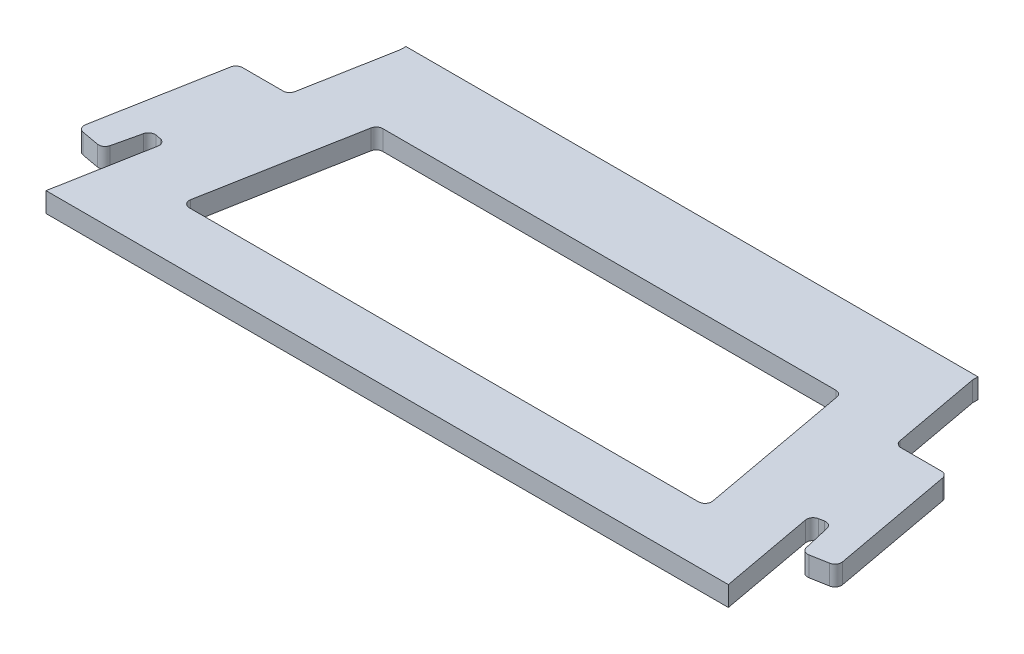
from build123d import *

# Parameters (mm, degrees)
BOSS_EXTRUDE1_DEPTH = 12


with BuildPart() as part:
    # Sketch1 → Boss-Extrude1 (new body)
    with BuildSketch(Plane(origin=(0, 0, 0), x_dir=(1, 0, 0), z_dir=(0, 1, 0))):
        with BuildLine():
            Line((0, 0), (10.523720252, 57.124709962))
            ThreePointArc((10.523720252, 57.124709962), (9.888523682, 60.111972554), (7.330401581, 61.780272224))
            Line((7.330401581, 61.780272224), (4.252092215, 62.360155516))
            ThreePointArc((4.252092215, 62.360155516), (1.324463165, 61.778382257), (-0.385272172, 59.331695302))
            Line((-0.385272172, 59.331695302), (-4.177618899, 42.955059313))
            ThreePointArc((-4.177618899, 42.955059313), (-5.875677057, 40.51602732), (-8.787522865, 39.921525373))
            Line((-8.787522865, 39.921525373), (-19.383346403, 41.841038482))
            ThreePointArc((-19.383346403, 41.841038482), (-21.96101101, 43.502911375), (-22.604125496, 46.50167447))
            Line((-22.604125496, 46.50167447), (-8.952598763, 120.604699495))
            ThreePointArc((-8.952598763, 120.604699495), (-7.578209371, 122.953987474), (-5.018795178, 123.88))
            Line((-5.018795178, 123.88), (19.491204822, 123.88))
            ThreePointArc((19.491204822, 123.88), (22.050619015, 124.806012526), (23.425008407, 127.155300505))
            Line((23.425008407, 127.155300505), (33.35, 181.03))
            Line((33.35, 181.03), (33.35, 184.33))
            Line((33.35, 184.33), (379.35, 184.33))
            Line((379.35, 184.33), (379.35, 181.03))
            Line((379.35, 181.03), (389.274991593, 127.155300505))
            ThreePointArc((389.274991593, 127.155300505), (390.649380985, 124.806012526), (393.208795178, 123.88))
            Line((393.208795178, 123.88), (417.718795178, 123.88))
            ThreePointArc((417.718795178, 123.88), (420.278209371, 122.953987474), (421.652598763, 120.604699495))
            Line((421.652598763, 120.604699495), (435.304125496, 46.50167447))
            ThreePointArc((435.304125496, 46.50167447), (434.66101101, 43.502911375), (432.083346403, 41.841038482))
            Line((432.083346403, 41.841038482), (421.487522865, 39.921525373))
            ThreePointArc((421.487522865, 39.921525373), (418.575677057, 40.51602732), (416.877618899, 42.955059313))
            Line((416.877618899, 42.955059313), (413.085272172, 59.331695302))
            ThreePointArc((413.085272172, 59.331695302), (411.375536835, 61.778382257), (408.447907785, 62.360155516))
            Line((408.447907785, 62.360155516), (405.369598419, 61.780272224))
            ThreePointArc((405.369598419, 61.780272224), (402.811476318, 60.111972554), (402.176279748, 57.124709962))
            Line((402.176279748, 57.124709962), (412.7, 0))
            Line((412.7, 0), (0, 0))
        make_face()
        with BuildLine():
            Line((343.339626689, 134.33), (69.360373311, 134.33))
            ThreePointArc((69.360373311, 134.33), (66.800959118, 133.403987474), (65.426569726, 131.054699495))
            Line((65.426569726, 131.054699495), (48.477997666, 39.054699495))
            ThreePointArc((48.477997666, 39.054699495), (49.337813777, 35.770585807), (52.411801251, 34.33))
            Line((52.411801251, 34.33), (360.288198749, 34.33))
            ThreePointArc((360.288198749, 34.33), (363.362186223, 35.770585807), (364.222002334, 39.054699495))
            Line((364.222002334, 39.054699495), (347.273430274, 131.054699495))
            ThreePointArc((347.273430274, 131.054699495), (345.899040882, 133.403987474), (343.339626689, 134.33))
        make_face(mode=Mode.SUBTRACT)
    extrude(amount=BOSS_EXTRUDE1_DEPTH)


solid = part.part
